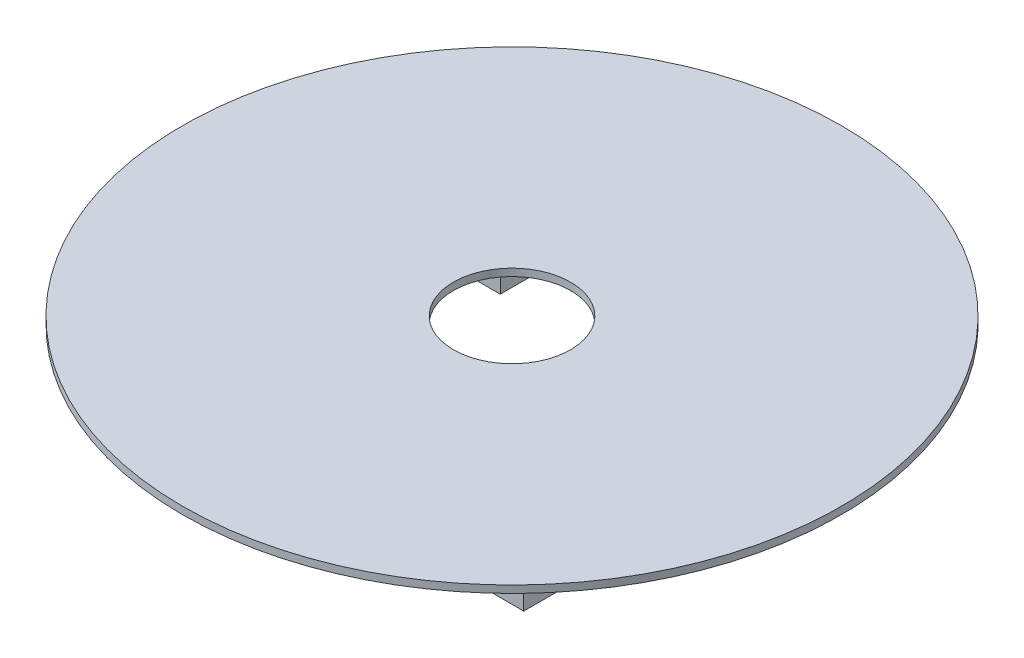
from build123d import *

# Parameters (mm, degrees)
SKETCH1_R           = 4500
SKETCH1_R_2         = 800
BOSS_EXTRUDE1_DEPTH = 100
SKETCH2_W           = 2493.452377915
SKETCH2_H           = 2493.452377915
SKETCH2_W_2         = 2173.452377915
SKETCH2_H_2         = 2173.452377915
BOSS_EXTRUDE2_DEPTH = 350


with BuildPart() as part:
    # Sketch1 → Boss-Extrude1 (new body)
    with BuildSketch(Plane(origin=(0, 0, 0), x_dir=(1, 0, 0), z_dir=(0, 1, 0))):
        with Locations(Location((0, 0, 0), (0, 0, 270))):
            Circle(SKETCH1_R)
        with Locations(Location((0, 0, 0), (0, 0, 270))):
            Circle(SKETCH1_R_2, mode=Mode.SUBTRACT)
    extrude(amount=BOSS_EXTRUDE1_DEPTH)

    # Sketch2 → Boss-Extrude2 (add)
    with BuildSketch(Plane(origin=(0, 0, 0), x_dir=(1, 0, 0), z_dir=(0, 1, 0))):
        with Locations((1873.832970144, 1873.832970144)):
            Rectangle(SKETCH2_W, SKETCH2_H)
        with Locations((-1873.832970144, 1873.832970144)):
            Rectangle(SKETCH2_W_2, SKETCH2_H)
        with Locations((-1873.832970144, -1873.832970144)):
            Rectangle(SKETCH2_W_2, SKETCH2_H_2)
        with Locations((1873.832970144, -1873.832970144)):
            Rectangle(SKETCH2_W, SKETCH2_H_2)
    extrude(amount=-BOSS_EXTRUDE2_DEPTH)


solid = part.part
